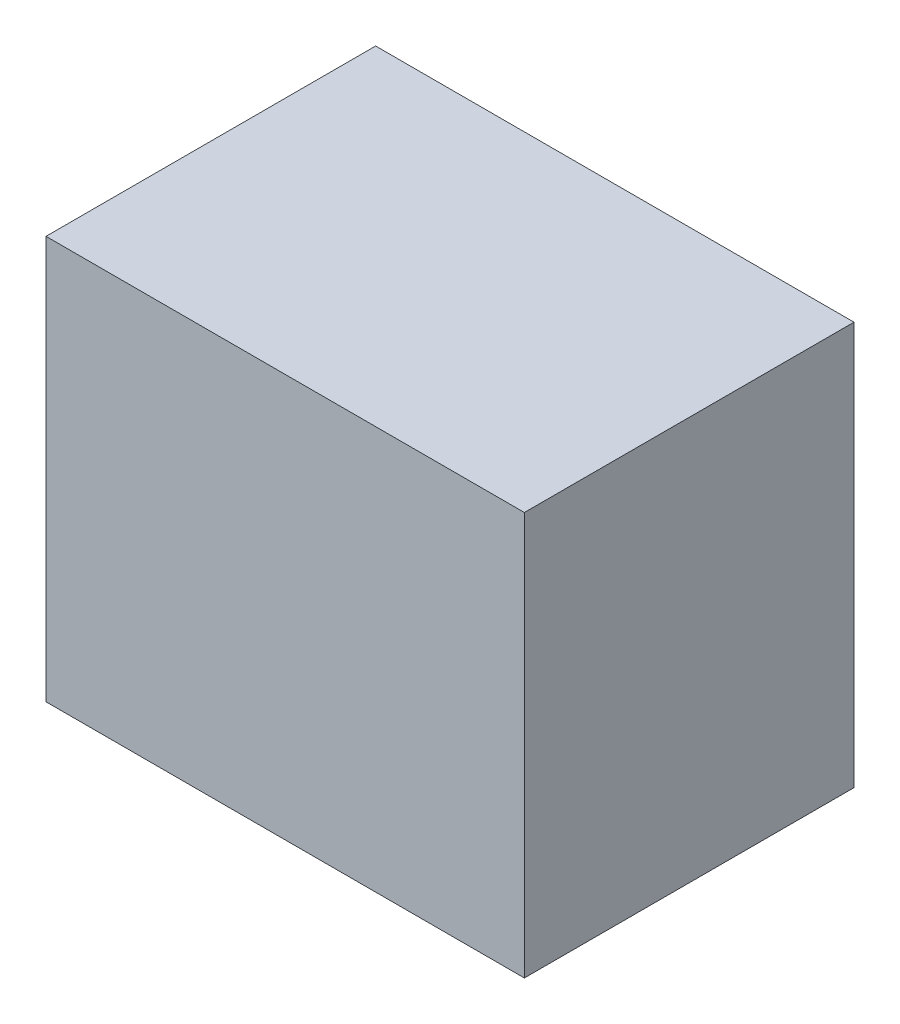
from build123d import *

# Parameters (mm, degrees)
SKETCH1_W           = 73.719717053
SKETCH1_H           = 62.128526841
BOSS_EXTRUDE1_DEPTH = 50.8


with BuildPart() as part:
    # Sketch1 → Boss-Extrude1 (new body)
    with BuildSketch(Plane.XY):
        with Locations((36.859858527, 31.064263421)):
            Rectangle(SKETCH1_W, SKETCH1_H)
    extrude(amount=BOSS_EXTRUDE1_DEPTH)


solid = part.part
